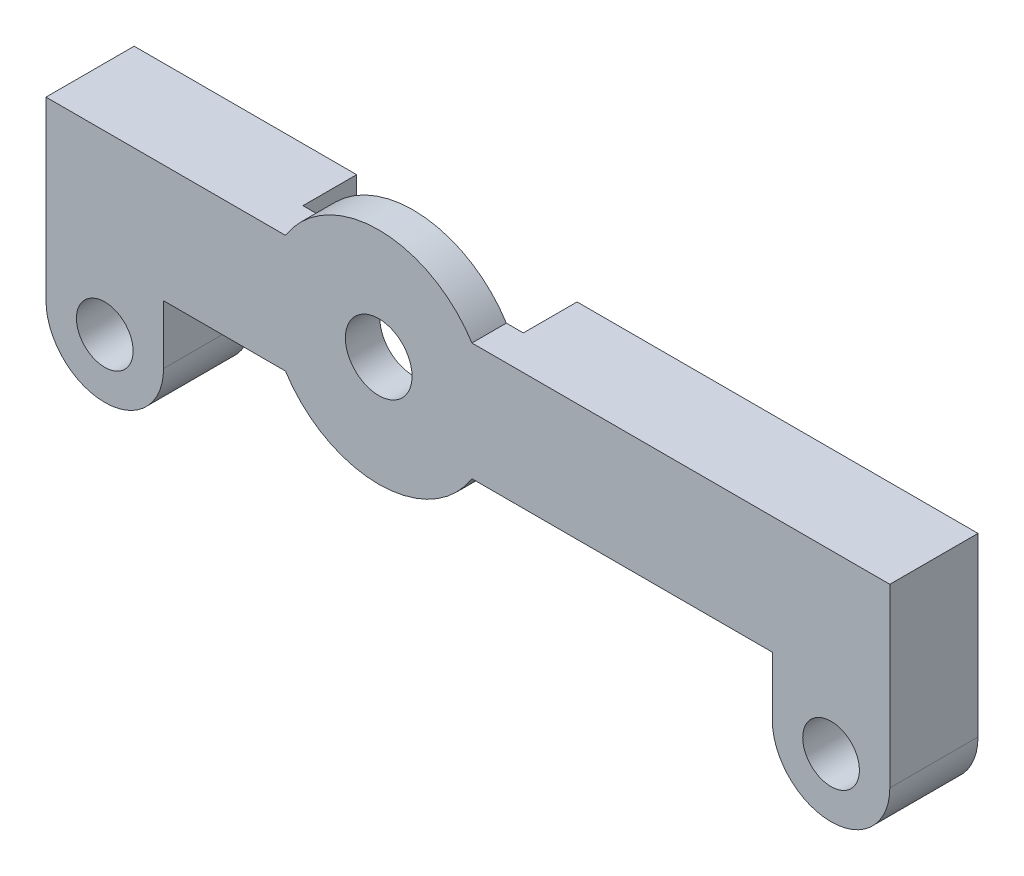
ISO-10303-21;
HEADER;
FILE_DESCRIPTION(('STEP AP214'),'2;1');
FILE_NAME('part.step','',(''),(''),'','','');
FILE_SCHEMA(('AUTOMOTIVE_DESIGN { 1 0 10303 214 1 1 1 1 }'));
ENDSEC;
DATA;
#1=APPLICATION_CONTEXT('core data for automotive mechanical design processes');
#2=APPLICATION_PROTOCOL_DEFINITION('international standard','automotive_design',2000,#1);
#3=PRODUCT_CONTEXT('',#1,'mechanical');
#4=PRODUCT('Part','Part','',(#3));
#5=PRODUCT_RELATED_PRODUCT_CATEGORY('part','',(#4));
#6=PRODUCT_DEFINITION_FORMATION('','',#4);
#7=PRODUCT_DEFINITION_CONTEXT('part definition',#1,'design');
#8=PRODUCT_DEFINITION('design','',#6,#7);
#9=PRODUCT_DEFINITION_SHAPE('','',#8);
#10=(LENGTH_UNIT() NAMED_UNIT(*) SI_UNIT(.MILLI.,.METRE.));
#11=(NAMED_UNIT(*) PLANE_ANGLE_UNIT() SI_UNIT($,.RADIAN.));
#12=(NAMED_UNIT(*) SI_UNIT($,.STERADIAN.) SOLID_ANGLE_UNIT());
#13=UNCERTAINTY_MEASURE_WITH_UNIT(LENGTH_MEASURE(1.E-05),#10,'distance_accuracy_value','');
#14=(GEOMETRIC_REPRESENTATION_CONTEXT(3) GLOBAL_UNCERTAINTY_ASSIGNED_CONTEXT((#13)) GLOBAL_UNIT_ASSIGNED_CONTEXT((#10,
#11,#12)) REPRESENTATION_CONTEXT('',''));
#15=CARTESIAN_POINT('',(0.,0.,0.));
#16=DIRECTION('',(0.,0.,1.));
#17=DIRECTION('',(1.,0.,0.));
#18=AXIS2_PLACEMENT_3D('',#15,#16,#17);
#19=CARTESIAN_POINT('',(-14.5,2.8,4.2));
#20=DIRECTION('',(0.,1.,0.));
#21=DIRECTION('',(0.,0.,1.));
#22=AXIS2_PLACEMENT_3D('',#19,#20,#21);
#23=PLANE('',#22);
#24=DIRECTION('',(-1.,0.,0.));
#25=VECTOR('',#24,1.);
#26=CARTESIAN_POINT('',(-9.5,2.8,2.56));
#27=LINE('',#26,#25);
#28=CARTESIAN_POINT('',(-8.69100213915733,2.8,2.56));
#29=VERTEX_POINT('',#28);
#30=CARTESIAN_POINT('',(-9.5,2.8,2.56));
#31=VERTEX_POINT('',#30);
#32=EDGE_CURVE('E306',#29,#31,#27,.T.);
#33=ORIENTED_EDGE('',*,*,#32,.F.);
#34=DIRECTION('',(0.,0.,1.));
#35=VECTOR('',#34,1.);
#36=CARTESIAN_POINT('',(-8.69100213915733,2.8,-12.2892424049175));
#37=LINE('',#36,#35);
#38=CARTESIAN_POINT('',(-8.69100213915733,2.8,4.2));
#39=VERTEX_POINT('',#38);
#40=EDGE_CURVE('E239',#29,#39,#37,.T.);
#41=ORIENTED_EDGE('',*,*,#40,.T.);
#42=DIRECTION('',(1.,0.,0.));
#43=VECTOR('',#42,1.);
#44=CARTESIAN_POINT('',(-14.5,2.8,4.2));
#45=LINE('',#44,#43);
#46=CARTESIAN_POINT('',(-14.5,2.8,4.2));
#47=VERTEX_POINT('',#46);
#48=EDGE_CURVE('E226',#47,#39,#45,.T.);
#49=ORIENTED_EDGE('',*,*,#48,.F.);
#50=DIRECTION('',(0.,0.,-1.));
#51=VECTOR('',#50,1.);
#52=CARTESIAN_POINT('',(-14.5,2.8,4.2));
#53=LINE('',#52,#51);
#54=CARTESIAN_POINT('',(-14.5,2.8,0.));
#55=VERTEX_POINT('',#54);
#56=EDGE_CURVE('E41',#47,#55,#53,.T.);
#57=ORIENTED_EDGE('',*,*,#56,.T.);
#58=DIRECTION('',(1.,0.,0.));
#59=VECTOR('',#58,1.);
#60=CARTESIAN_POINT('',(-14.5,2.8,0.));
#61=LINE('',#60,#59);
#62=CARTESIAN_POINT('',(-9.5,2.8,0.));
#63=VERTEX_POINT('',#62);
#64=EDGE_CURVE('E185',#55,#63,#61,.T.);
#65=ORIENTED_EDGE('',*,*,#64,.T.);
#66=DIRECTION('',(0.,0.,-1.));
#67=VECTOR('',#66,1.);
#68=CARTESIAN_POINT('',(-9.5,2.8,2.56));
#69=LINE('',#68,#67);
#70=EDGE_CURVE('E248',#31,#63,#69,.T.);
#71=ORIENTED_EDGE('',*,*,#70,.F.);
#72=EDGE_LOOP('',(#33,#41,#49,#57,#65,#71));
#73=FACE_BOUND('',#72,.T.);
#74=ADVANCED_FACE('F32',(#73),#23,.F.);
#75=CARTESIAN_POINT('',(-20.1,8.4,4.2));
#76=DIRECTION('',(0.,-1.,0.));
#77=DIRECTION('',(0.,0.,-1.));
#78=AXIS2_PLACEMENT_3D('',#75,#76,#77);
#79=PLANE('',#78);
#80=DIRECTION('',(1.,0.,0.));
#81=VECTOR('',#80,1.);
#82=CARTESIAN_POINT('',(-9.5,8.4,2.56));
#83=LINE('',#82,#81);
#84=CARTESIAN_POINT('',(0.191002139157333,8.4,2.56));
#85=VERTEX_POINT('',#84);
#86=CARTESIAN_POINT('',(1.,8.4,2.56));
#87=VERTEX_POINT('',#86);
#88=EDGE_CURVE('E162',#85,#87,#83,.T.);
#89=ORIENTED_EDGE('',*,*,#88,.F.);
#90=DIRECTION('',(0.,0.,1.));
#91=VECTOR('',#90,1.);
#92=CARTESIAN_POINT('',(0.191002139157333,8.4,-12.2892424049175));
#93=LINE('',#92,#91);
#94=CARTESIAN_POINT('',(0.191002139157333,8.4,4.2));
#95=VERTEX_POINT('',#94);
#96=EDGE_CURVE('E147',#85,#95,#93,.T.);
#97=ORIENTED_EDGE('',*,*,#96,.T.);
#98=DIRECTION('',(-1.,0.,0.));
#99=VECTOR('',#98,1.);
#100=CARTESIAN_POINT('',(-20.1,8.4,4.2));
#101=LINE('',#100,#99);
#102=CARTESIAN_POINT('',(20.1,8.4,4.2));
#103=VERTEX_POINT('',#102);
#104=EDGE_CURVE('E160',#103,#95,#101,.T.);
#105=ORIENTED_EDGE('',*,*,#104,.F.);
#106=DIRECTION('',(0.,0.,-1.));
#107=VECTOR('',#106,1.);
#108=CARTESIAN_POINT('',(20.1,8.4,4.2));
#109=LINE('',#108,#107);
#110=CARTESIAN_POINT('',(20.1,8.4,0.));
#111=VERTEX_POINT('',#110);
#112=EDGE_CURVE('E206',#103,#111,#109,.T.);
#113=ORIENTED_EDGE('',*,*,#112,.T.);
#114=DIRECTION('',(-1.,0.,0.));
#115=VECTOR('',#114,1.);
#116=CARTESIAN_POINT('',(-20.1,8.4,0.));
#117=LINE('',#116,#115);
#118=CARTESIAN_POINT('',(1.,8.4,0.));
#119=VERTEX_POINT('',#118);
#120=EDGE_CURVE('E195',#111,#119,#117,.T.);
#121=ORIENTED_EDGE('',*,*,#120,.T.);
#122=DIRECTION('',(0.,0.,-1.));
#123=VECTOR('',#122,1.);
#124=CARTESIAN_POINT('',(1.,8.4,2.56));
#125=LINE('',#124,#123);
#126=EDGE_CURVE('E253',#87,#119,#125,.T.);
#127=ORIENTED_EDGE('',*,*,#126,.F.);
#128=EDGE_LOOP('',(#89,#97,#105,#113,#121,#127));
#129=FACE_BOUND('',#128,.T.);
#130=ADVANCED_FACE('F158',(#129),#79,.F.);
#131=CARTESIAN_POINT('',(-17.3,0.,0.));
#132=DIRECTION('',(0.,0.,1.));
#133=DIRECTION('',(1.,0.,0.));
#134=AXIS2_PLACEMENT_3D('',#131,#132,#133);
#135=PLANE('',#134);
#136=CARTESIAN_POINT('',(-17.3,0.,0.));
#137=DIRECTION('',(0.,0.,1.));
#138=DIRECTION('',(1.,0.,0.));
#139=AXIS2_PLACEMENT_3D('',#136,#137,#138);
#140=CIRCLE('',#139,1.35);
#141=CARTESIAN_POINT('',(-15.95,0.,0.));
#142=VERTEX_POINT('',#141);
#143=EDGE_CURVE('E266',#142,#142,#140,.T.);
#144=ORIENTED_EDGE('',*,*,#143,.T.);
#145=EDGE_LOOP('',(#144));
#146=FACE_BOUND('',#145,.T.);
#147=CARTESIAN_POINT('',(-9.5,8.4,0.));
#148=VERTEX_POINT('',#147);
#149=CARTESIAN_POINT('',(-20.1,8.4,0.));
#150=VERTEX_POINT('',#149);
#151=EDGE_CURVE('E194',#148,#150,#117,.T.);
#152=ORIENTED_EDGE('',*,*,#151,.F.);
#153=DIRECTION('',(0.,1.,0.));
#154=VECTOR('',#153,1.);
#155=CARTESIAN_POINT('',(-9.5,2.8,0.));
#156=LINE('',#155,#154);
#157=EDGE_CURVE('E233',#63,#148,#156,.T.);
#158=ORIENTED_EDGE('',*,*,#157,.F.);
#159=ORIENTED_EDGE('',*,*,#64,.F.);
#160=DIRECTION('',(0.,1.,0.));
#161=VECTOR('',#160,1.);
#162=CARTESIAN_POINT('',(-14.5,0.,0.));
#163=LINE('',#162,#161);
#164=CARTESIAN_POINT('',(-14.5,0.,0.));
#165=VERTEX_POINT('',#164);
#166=EDGE_CURVE('E181',#165,#55,#163,.T.);
#167=ORIENTED_EDGE('',*,*,#166,.F.);
#168=CARTESIAN_POINT('',(-17.3,0.,0.));
#169=DIRECTION('',(0.,0.,1.));
#170=DIRECTION('',(1.,0.,0.));
#171=AXIS2_PLACEMENT_3D('',#168,#169,#170);
#172=CIRCLE('',#171,2.8);
#173=CARTESIAN_POINT('',(-20.1,0.,0.));
#174=VERTEX_POINT('',#173);
#175=EDGE_CURVE('E178',#174,#165,#172,.T.);
#176=ORIENTED_EDGE('',*,*,#175,.F.);
#177=DIRECTION('',(0.,-1.,0.));
#178=VECTOR('',#177,1.);
#179=CARTESIAN_POINT('',(-20.1,0.,0.));
#180=LINE('',#179,#178);
#181=EDGE_CURVE('E198',#150,#174,#180,.T.);
#182=ORIENTED_EDGE('',*,*,#181,.F.);
#183=EDGE_LOOP('',(#152,#158,#159,#167,#176,#182));
#184=FACE_BOUND('',#183,.T.);
#185=ADVANCED_FACE('F231',(#146,#184),#135,.F.);
#186=CARTESIAN_POINT('',(-4.25,5.6,4.2));
#187=DIRECTION('',(0.,0.,-1.));
#188=DIRECTION('',(-1.,0.,0.));
#189=AXIS2_PLACEMENT_3D('',#186,#187,#188);
#190=CYLINDRICAL_SURFACE('',#189,1.5875);
#191=CARTESIAN_POINT('',(-4.25,5.6,4.2));
#192=DIRECTION('',(0.,0.,1.));
#193=DIRECTION('',(1.,0.,0.));
#194=AXIS2_PLACEMENT_3D('',#191,#192,#193);
#195=CIRCLE('',#194,1.5875);
#196=CARTESIAN_POINT('',(-2.6625,5.6,4.2));
#197=VERTEX_POINT('',#196);
#198=EDGE_CURVE('E260',#197,#197,#195,.T.);
#199=ORIENTED_EDGE('',*,*,#198,.T.);
#200=EDGE_LOOP('',(#199));
#201=FACE_BOUND('',#200,.T.);
#202=CARTESIAN_POINT('',(-4.25,5.6,2.56));
#203=DIRECTION('',(0.,0.,-1.));
#204=DIRECTION('',(-1.,0.,0.));
#205=AXIS2_PLACEMENT_3D('',#202,#203,#204);
#206=CIRCLE('',#205,1.5875);
#207=CARTESIAN_POINT('',(-5.8375,5.6,2.56));
#208=VERTEX_POINT('',#207);
#209=EDGE_CURVE('E36',#208,#208,#206,.T.);
#210=ORIENTED_EDGE('',*,*,#209,.T.);
#211=EDGE_LOOP('',(#210));
#212=FACE_BOUND('',#211,.T.);
#213=ADVANCED_FACE('F368',(#201,#212),#190,.F.);
#214=CARTESIAN_POINT('',(-17.3,0.,4.2));
#215=DIRECTION('',(0.,0.,1.));
#216=DIRECTION('',(1.,0.,0.));
#217=AXIS2_PLACEMENT_3D('',#214,#215,#216);
#218=PLANE('',#217);
#219=ORIENTED_EDGE('',*,*,#104,.T.);
#220=CARTESIAN_POINT('',(-4.25,5.6,4.2));
#221=DIRECTION('',(0.,0.,1.));
#222=DIRECTION('',(1.,0.,0.));
#223=AXIS2_PLACEMENT_3D('',#220,#221,#222);
#224=CIRCLE('',#223,5.25);
#225=CARTESIAN_POINT('',(-8.69100213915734,8.4,4.2));
#226=VERTEX_POINT('',#225);
#227=EDGE_CURVE('E144',#95,#226,#224,.T.);
#228=ORIENTED_EDGE('',*,*,#227,.T.);
#229=CARTESIAN_POINT('',(-20.1,8.4,4.2));
#230=VERTEX_POINT('',#229);
#231=EDGE_CURVE('E171',#226,#230,#101,.T.);
#232=ORIENTED_EDGE('',*,*,#231,.T.);
#233=DIRECTION('',(0.,-1.,0.));
#234=VECTOR('',#233,1.);
#235=CARTESIAN_POINT('',(-20.1,0.,4.2));
#236=LINE('',#235,#234);
#237=CARTESIAN_POINT('',(-20.1,0.,4.2));
#238=VERTEX_POINT('',#237);
#239=EDGE_CURVE('E170',#230,#238,#236,.T.);
#240=ORIENTED_EDGE('',*,*,#239,.T.);
#241=CARTESIAN_POINT('',(-17.3,0.,4.2));
#242=DIRECTION('',(0.,0.,1.));
#243=DIRECTION('',(1.,0.,0.));
#244=AXIS2_PLACEMENT_3D('',#241,#242,#243);
#245=CIRCLE('',#244,2.8);
#246=CARTESIAN_POINT('',(-14.5,0.,4.2));
#247=VERTEX_POINT('',#246);
#248=EDGE_CURVE('E200',#238,#247,#245,.T.);
#249=ORIENTED_EDGE('',*,*,#248,.T.);
#250=DIRECTION('',(0.,1.,0.));
#251=VECTOR('',#250,1.);
#252=CARTESIAN_POINT('',(-14.5,0.,4.2));
#253=LINE('',#252,#251);
#254=EDGE_CURVE('E273',#247,#47,#253,.T.);
#255=ORIENTED_EDGE('',*,*,#254,.T.);
#256=ORIENTED_EDGE('',*,*,#48,.T.);
#257=CARTESIAN_POINT('',(0.191002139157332,2.8,4.2));
#258=VERTEX_POINT('',#257);
#259=EDGE_CURVE('E154',#39,#258,#224,.T.);
#260=ORIENTED_EDGE('',*,*,#259,.T.);
#261=CARTESIAN_POINT('',(14.5,2.8,4.2));
#262=VERTEX_POINT('',#261);
#263=EDGE_CURVE('E275',#258,#262,#45,.T.);
#264=ORIENTED_EDGE('',*,*,#263,.T.);
#265=DIRECTION('',(0.,-1.,0.));
#266=VECTOR('',#265,1.);
#267=CARTESIAN_POINT('',(14.5,0.,4.2));
#268=LINE('',#267,#266);
#269=CARTESIAN_POINT('',(14.5,0.,4.2));
#270=VERTEX_POINT('',#269);
#271=EDGE_CURVE('E277',#262,#270,#268,.T.);
#272=ORIENTED_EDGE('',*,*,#271,.T.);
#273=CARTESIAN_POINT('',(17.3,0.,4.2));
#274=DIRECTION('',(0.,0.,1.));
#275=DIRECTION('',(-1.,0.,0.));
#276=AXIS2_PLACEMENT_3D('',#273,#274,#275);
#277=CIRCLE('',#276,2.8);
#278=CARTESIAN_POINT('',(20.1,0.,4.2));
#279=VERTEX_POINT('',#278);
#280=EDGE_CURVE('E278',#270,#279,#277,.T.);
#281=ORIENTED_EDGE('',*,*,#280,.T.);
#282=DIRECTION('',(0.,1.,0.));
#283=VECTOR('',#282,1.);
#284=CARTESIAN_POINT('',(20.1,0.,4.2));
#285=LINE('',#284,#283);
#286=EDGE_CURVE('E168',#279,#103,#285,.T.);
#287=ORIENTED_EDGE('',*,*,#286,.T.);
#288=EDGE_LOOP('',(#219,#228,#232,#240,#249,#255,#256,#260,#264,#272,#281,#287));
#289=FACE_BOUND('',#288,.T.);
#290=CARTESIAN_POINT('',(17.3,0.,4.2));
#291=DIRECTION('',(0.,0.,1.));
#292=DIRECTION('',(-1.,0.,0.));
#293=AXIS2_PLACEMENT_3D('',#290,#291,#292);
#294=CIRCLE('',#293,1.35);
#295=CARTESIAN_POINT('',(15.95,0.,4.2));
#296=VERTEX_POINT('',#295);
#297=EDGE_CURVE('E257',#296,#296,#294,.T.);
#298=ORIENTED_EDGE('',*,*,#297,.F.);
#299=EDGE_LOOP('',(#298));
#300=FACE_BOUND('',#299,.T.);
#301=ORIENTED_EDGE('',*,*,#198,.F.);
#302=EDGE_LOOP('',(#301));
#303=FACE_BOUND('',#302,.T.);
#304=CARTESIAN_POINT('',(-17.3,0.,4.2));
#305=DIRECTION('',(0.,0.,1.));
#306=DIRECTION('',(1.,0.,0.));
#307=AXIS2_PLACEMENT_3D('',#304,#305,#306);
#308=CIRCLE('',#307,1.35);
#309=CARTESIAN_POINT('',(-15.95,0.,4.2));
#310=VERTEX_POINT('',#309);
#311=EDGE_CURVE('E182',#310,#310,#308,.T.);
#312=ORIENTED_EDGE('',*,*,#311,.F.);
#313=EDGE_LOOP('',(#312));
#314=FACE_BOUND('',#313,.T.);
#315=ADVANCED_FACE('F165',(#289,#300,#303,#314),#218,.T.);
#316=CARTESIAN_POINT('',(1.,2.8,0.));
#317=VERTEX_POINT('',#316);
#318=CARTESIAN_POINT('',(14.5,2.8,0.));
#319=VERTEX_POINT('',#318);
#320=EDGE_CURVE('E184',#317,#319,#61,.T.);
#321=ORIENTED_EDGE('',*,*,#320,.F.);
#322=DIRECTION('',(0.,-1.,0.));
#323=VECTOR('',#322,1.);
#324=CARTESIAN_POINT('',(1.,2.8,0.));
#325=LINE('',#324,#323);
#326=EDGE_CURVE('E238',#119,#317,#325,.T.);
#327=ORIENTED_EDGE('',*,*,#326,.F.);
#328=ORIENTED_EDGE('',*,*,#120,.F.);
#329=DIRECTION('',(0.,1.,0.));
#330=VECTOR('',#329,1.);
#331=CARTESIAN_POINT('',(20.1,0.,0.));
#332=LINE('',#331,#330);
#333=CARTESIAN_POINT('',(20.1,0.,0.));
#334=VERTEX_POINT('',#333);
#335=EDGE_CURVE('E192',#334,#111,#332,.T.);
#336=ORIENTED_EDGE('',*,*,#335,.F.);
#337=CARTESIAN_POINT('',(17.3,0.,0.));
#338=DIRECTION('',(0.,0.,1.));
#339=DIRECTION('',(-1.,0.,0.));
#340=AXIS2_PLACEMENT_3D('',#337,#338,#339);
#341=CIRCLE('',#340,2.8);
#342=CARTESIAN_POINT('',(14.5,0.,0.));
#343=VERTEX_POINT('',#342);
#344=EDGE_CURVE('E190',#343,#334,#341,.T.);
#345=ORIENTED_EDGE('',*,*,#344,.F.);
#346=DIRECTION('',(0.,-1.,0.));
#347=VECTOR('',#346,1.);
#348=CARTESIAN_POINT('',(14.5,0.,0.));
#349=LINE('',#348,#347);
#350=EDGE_CURVE('E188',#319,#343,#349,.T.);
#351=ORIENTED_EDGE('',*,*,#350,.F.);
#352=EDGE_LOOP('',(#321,#327,#328,#336,#345,#351));
#353=FACE_BOUND('',#352,.T.);
#354=CARTESIAN_POINT('',(17.3,0.,0.));
#355=DIRECTION('',(0.,0.,1.));
#356=DIRECTION('',(-1.,0.,0.));
#357=AXIS2_PLACEMENT_3D('',#354,#355,#356);
#358=CIRCLE('',#357,1.35);
#359=CARTESIAN_POINT('',(15.95,0.,0.));
#360=VERTEX_POINT('',#359);
#361=EDGE_CURVE('E261',#360,#360,#358,.T.);
#362=ORIENTED_EDGE('',*,*,#361,.T.);
#363=EDGE_LOOP('',(#362));
#364=FACE_BOUND('',#363,.T.);
#365=ADVANCED_FACE('F293',(#353,#364),#135,.F.);
#366=CARTESIAN_POINT('',(-17.3,0.,4.2));
#367=DIRECTION('',(0.,0.,-1.));
#368=DIRECTION('',(-1.,0.,0.));
#369=AXIS2_PLACEMENT_3D('',#366,#367,#368);
#370=CYLINDRICAL_SURFACE('',#369,2.8);
#371=ORIENTED_EDGE('',*,*,#175,.T.);
#372=DIRECTION('',(0.,0.,-1.));
#373=VECTOR('',#372,1.);
#374=CARTESIAN_POINT('',(-14.5,0.,4.2));
#375=LINE('',#374,#373);
#376=EDGE_CURVE('E11',#247,#165,#375,.T.);
#377=ORIENTED_EDGE('',*,*,#376,.F.);
#378=ORIENTED_EDGE('',*,*,#248,.F.);
#379=DIRECTION('',(0.,0.,-1.));
#380=VECTOR('',#379,1.);
#381=CARTESIAN_POINT('',(-20.1,0.,4.2));
#382=LINE('',#381,#380);
#383=EDGE_CURVE('E173',#238,#174,#382,.T.);
#384=ORIENTED_EDGE('',*,*,#383,.T.);
#385=EDGE_LOOP('',(#371,#377,#378,#384));
#386=FACE_BOUND('',#385,.T.);
#387=ADVANCED_FACE('F34',(#386),#370,.T.);
#388=CARTESIAN_POINT('',(-14.5,0.,4.2));
#389=DIRECTION('',(-1.,0.,0.));
#390=DIRECTION('',(0.,0.,1.));
#391=AXIS2_PLACEMENT_3D('',#388,#389,#390);
#392=PLANE('',#391);
#393=ORIENTED_EDGE('',*,*,#166,.T.);
#394=ORIENTED_EDGE('',*,*,#56,.F.);
#395=ORIENTED_EDGE('',*,*,#254,.F.);
#396=ORIENTED_EDGE('',*,*,#376,.T.);
#397=EDGE_LOOP('',(#393,#394,#395,#396));
#398=FACE_BOUND('',#397,.T.);
#399=ADVANCED_FACE('F326',(#398),#392,.F.);
#400=ORIENTED_EDGE('',*,*,#263,.F.);
#401=DIRECTION('',(0.,0.,1.));
#402=VECTOR('',#401,1.);
#403=CARTESIAN_POINT('',(0.191002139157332,2.8,-12.2892424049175));
#404=LINE('',#403,#402);
#405=CARTESIAN_POINT('',(0.191002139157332,2.8,2.56));
#406=VERTEX_POINT('',#405);
#407=EDGE_CURVE('E163',#258,#406,#404,.F.);
#408=ORIENTED_EDGE('',*,*,#407,.T.);
#409=CARTESIAN_POINT('',(1.,2.8,2.56));
#410=VERTEX_POINT('',#409);
#411=EDGE_CURVE('E245',#410,#406,#27,.T.);
#412=ORIENTED_EDGE('',*,*,#411,.F.);
#413=DIRECTION('',(0.,0.,-1.));
#414=VECTOR('',#413,1.);
#415=CARTESIAN_POINT('',(1.,2.8,2.56));
#416=LINE('',#415,#414);
#417=EDGE_CURVE('E250',#410,#317,#416,.T.);
#418=ORIENTED_EDGE('',*,*,#417,.T.);
#419=ORIENTED_EDGE('',*,*,#320,.T.);
#420=DIRECTION('',(0.,0.,-1.));
#421=VECTOR('',#420,1.);
#422=CARTESIAN_POINT('',(14.5,2.8,4.2));
#423=LINE('',#422,#421);
#424=EDGE_CURVE('E214',#262,#319,#423,.T.);
#425=ORIENTED_EDGE('',*,*,#424,.F.);
#426=EDGE_LOOP('',(#400,#408,#412,#418,#419,#425));
#427=FACE_BOUND('',#426,.T.);
#428=ADVANCED_FACE('F303',(#427),#23,.F.);
#429=CARTESIAN_POINT('',(14.5,0.,4.2));
#430=DIRECTION('',(1.,0.,0.));
#431=DIRECTION('',(0.,0.,-1.));
#432=AXIS2_PLACEMENT_3D('',#429,#430,#431);
#433=PLANE('',#432);
#434=ORIENTED_EDGE('',*,*,#350,.T.);
#435=DIRECTION('',(0.,0.,-1.));
#436=VECTOR('',#435,1.);
#437=CARTESIAN_POINT('',(14.5,0.,4.2));
#438=LINE('',#437,#436);
#439=EDGE_CURVE('E211',#270,#343,#438,.T.);
#440=ORIENTED_EDGE('',*,*,#439,.F.);
#441=ORIENTED_EDGE('',*,*,#271,.F.);
#442=ORIENTED_EDGE('',*,*,#424,.T.);
#443=EDGE_LOOP('',(#434,#440,#441,#442));
#444=FACE_BOUND('',#443,.T.);
#445=ADVANCED_FACE('F318',(#444),#433,.F.);
#446=CARTESIAN_POINT('',(17.3,0.,4.2));
#447=DIRECTION('',(0.,0.,-1.));
#448=DIRECTION('',(-1.,0.,0.));
#449=AXIS2_PLACEMENT_3D('',#446,#447,#448);
#450=CYLINDRICAL_SURFACE('',#449,2.8);
#451=ORIENTED_EDGE('',*,*,#344,.T.);
#452=DIRECTION('',(0.,0.,-1.));
#453=VECTOR('',#452,1.);
#454=CARTESIAN_POINT('',(20.1,0.,4.2));
#455=LINE('',#454,#453);
#456=EDGE_CURVE('E208',#279,#334,#455,.T.);
#457=ORIENTED_EDGE('',*,*,#456,.F.);
#458=ORIENTED_EDGE('',*,*,#280,.F.);
#459=ORIENTED_EDGE('',*,*,#439,.T.);
#460=EDGE_LOOP('',(#451,#457,#458,#459));
#461=FACE_BOUND('',#460,.T.);
#462=ADVANCED_FACE('F284',(#461),#450,.T.);
#463=CARTESIAN_POINT('',(20.1,0.,4.2));
#464=DIRECTION('',(-1.,0.,0.));
#465=DIRECTION('',(0.,0.,1.));
#466=AXIS2_PLACEMENT_3D('',#463,#464,#465);
#467=PLANE('',#466);
#468=ORIENTED_EDGE('',*,*,#335,.T.);
#469=ORIENTED_EDGE('',*,*,#112,.F.);
#470=ORIENTED_EDGE('',*,*,#286,.F.);
#471=ORIENTED_EDGE('',*,*,#456,.T.);
#472=EDGE_LOOP('',(#468,#469,#470,#471));
#473=FACE_BOUND('',#472,.T.);
#474=ADVANCED_FACE('F288',(#473),#467,.F.);
#475=ORIENTED_EDGE('',*,*,#231,.F.);
#476=DIRECTION('',(0.,0.,1.));
#477=VECTOR('',#476,1.);
#478=CARTESIAN_POINT('',(-8.69100213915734,8.4,-12.2892424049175));
#479=LINE('',#478,#477);
#480=CARTESIAN_POINT('',(-8.69100213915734,8.4,2.56));
#481=VERTEX_POINT('',#480);
#482=EDGE_CURVE('E150',#226,#481,#479,.F.);
#483=ORIENTED_EDGE('',*,*,#482,.T.);
#484=CARTESIAN_POINT('',(-9.5,8.4,2.56));
#485=VERTEX_POINT('',#484);
#486=EDGE_CURVE('E309',#485,#481,#83,.T.);
#487=ORIENTED_EDGE('',*,*,#486,.F.);
#488=DIRECTION('',(0.,0.,-1.));
#489=VECTOR('',#488,1.);
#490=CARTESIAN_POINT('',(-9.5,8.4,2.56));
#491=LINE('',#490,#489);
#492=EDGE_CURVE('E255',#485,#148,#491,.T.);
#493=ORIENTED_EDGE('',*,*,#492,.T.);
#494=ORIENTED_EDGE('',*,*,#151,.T.);
#495=DIRECTION('',(0.,0.,-1.));
#496=VECTOR('',#495,1.);
#497=CARTESIAN_POINT('',(-20.1,8.4,4.2));
#498=LINE('',#497,#496);
#499=EDGE_CURVE('E203',#230,#150,#498,.T.);
#500=ORIENTED_EDGE('',*,*,#499,.F.);
#501=EDGE_LOOP('',(#475,#483,#487,#493,#494,#500));
#502=FACE_BOUND('',#501,.T.);
#503=ADVANCED_FACE('F333',(#502),#79,.F.);
#504=CARTESIAN_POINT('',(-20.1,0.,4.2));
#505=DIRECTION('',(1.,0.,0.));
#506=DIRECTION('',(0.,0.,-1.));
#507=AXIS2_PLACEMENT_3D('',#504,#505,#506);
#508=PLANE('',#507);
#509=ORIENTED_EDGE('',*,*,#181,.T.);
#510=ORIENTED_EDGE('',*,*,#383,.F.);
#511=ORIENTED_EDGE('',*,*,#239,.F.);
#512=ORIENTED_EDGE('',*,*,#499,.T.);
#513=EDGE_LOOP('',(#509,#510,#511,#512));
#514=FACE_BOUND('',#513,.T.);
#515=ADVANCED_FACE('F343',(#514),#508,.F.);
#516=CARTESIAN_POINT('',(-17.3,0.,4.2));
#517=DIRECTION('',(0.,0.,-1.));
#518=DIRECTION('',(-1.,0.,0.));
#519=AXIS2_PLACEMENT_3D('',#516,#517,#518);
#520=CYLINDRICAL_SURFACE('',#519,1.35);
#521=ORIENTED_EDGE('',*,*,#311,.T.);
#522=EDGE_LOOP('',(#521));
#523=FACE_BOUND('',#522,.T.);
#524=ORIENTED_EDGE('',*,*,#143,.F.);
#525=EDGE_LOOP('',(#524));
#526=FACE_BOUND('',#525,.T.);
#527=ADVANCED_FACE('F366',(#523,#526),#520,.F.);
#528=CARTESIAN_POINT('',(17.3,0.,4.2));
#529=DIRECTION('',(0.,0.,-1.));
#530=DIRECTION('',(-1.,0.,0.));
#531=AXIS2_PLACEMENT_3D('',#528,#529,#530);
#532=CYLINDRICAL_SURFACE('',#531,1.35);
#533=ORIENTED_EDGE('',*,*,#297,.T.);
#534=EDGE_LOOP('',(#533));
#535=FACE_BOUND('',#534,.T.);
#536=ORIENTED_EDGE('',*,*,#361,.F.);
#537=EDGE_LOOP('',(#536));
#538=FACE_BOUND('',#537,.T.);
#539=ADVANCED_FACE('F363',(#535,#538),#532,.F.);
#540=CARTESIAN_POINT('',(-9.5,2.8,2.56));
#541=DIRECTION('',(-1.,0.,0.));
#542=DIRECTION('',(0.,0.,1.));
#543=AXIS2_PLACEMENT_3D('',#540,#541,#542);
#544=PLANE('',#543);
#545=ORIENTED_EDGE('',*,*,#157,.T.);
#546=ORIENTED_EDGE('',*,*,#492,.F.);
#547=DIRECTION('',(0.,1.,0.));
#548=VECTOR('',#547,1.);
#549=CARTESIAN_POINT('',(-9.5,2.8,2.56));
#550=LINE('',#549,#548);
#551=EDGE_CURVE('E241',#31,#485,#550,.T.);
#552=ORIENTED_EDGE('',*,*,#551,.F.);
#553=ORIENTED_EDGE('',*,*,#70,.T.);
#554=EDGE_LOOP('',(#545,#546,#552,#553));
#555=FACE_BOUND('',#554,.T.);
#556=ADVANCED_FACE('F348',(#555),#544,.F.);
#557=CARTESIAN_POINT('',(1.,2.8,2.56));
#558=DIRECTION('',(1.,0.,0.));
#559=DIRECTION('',(0.,0.,-1.));
#560=AXIS2_PLACEMENT_3D('',#557,#558,#559);
#561=PLANE('',#560);
#562=ORIENTED_EDGE('',*,*,#326,.T.);
#563=ORIENTED_EDGE('',*,*,#417,.F.);
#564=DIRECTION('',(0.,-1.,0.));
#565=VECTOR('',#564,1.);
#566=CARTESIAN_POINT('',(1.,2.8,2.56));
#567=LINE('',#566,#565);
#568=EDGE_CURVE('E307',#87,#410,#567,.T.);
#569=ORIENTED_EDGE('',*,*,#568,.F.);
#570=ORIENTED_EDGE('',*,*,#126,.T.);
#571=EDGE_LOOP('',(#562,#563,#569,#570));
#572=FACE_BOUND('',#571,.T.);
#573=ADVANCED_FACE('F298',(#572),#561,.F.);
#574=CARTESIAN_POINT('',(0.,0.,2.56));
#575=DIRECTION('',(0.,0.,-1.));
#576=DIRECTION('',(-1.,0.,0.));
#577=AXIS2_PLACEMENT_3D('',#574,#575,#576);
#578=PLANE('',#577);
#579=ORIENTED_EDGE('',*,*,#551,.T.);
#580=ORIENTED_EDGE('',*,*,#486,.T.);
#581=CARTESIAN_POINT('',(-4.25,5.6,2.56));
#582=DIRECTION('',(0.,0.,-1.));
#583=DIRECTION('',(-1.,0.,0.));
#584=AXIS2_PLACEMENT_3D('',#581,#582,#583);
#585=CIRCLE('',#584,5.25);
#586=EDGE_CURVE('E55',#85,#481,#585,.F.);
#587=ORIENTED_EDGE('',*,*,#586,.F.);
#588=ORIENTED_EDGE('',*,*,#88,.T.);
#589=ORIENTED_EDGE('',*,*,#568,.T.);
#590=ORIENTED_EDGE('',*,*,#411,.T.);
#591=EDGE_CURVE('E48',#29,#406,#585,.F.);
#592=ORIENTED_EDGE('',*,*,#591,.F.);
#593=ORIENTED_EDGE('',*,*,#32,.T.);
#594=EDGE_LOOP('',(#579,#580,#587,#588,#589,#590,#592,#593));
#595=FACE_BOUND('',#594,.T.);
#596=ORIENTED_EDGE('',*,*,#209,.F.);
#597=EDGE_LOOP('',(#596));
#598=FACE_BOUND('',#597,.T.);
#599=ADVANCED_FACE('F355',(#595,#598),#578,.T.);
#600=CARTESIAN_POINT('',(-4.25,5.6,-12.2892424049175));
#601=DIRECTION('',(0.,0.,1.));
#602=DIRECTION('',(1.,0.,0.));
#603=AXIS2_PLACEMENT_3D('',#600,#601,#602);
#604=CYLINDRICAL_SURFACE('',#603,5.25);
#605=ORIENTED_EDGE('',*,*,#96,.F.);
#606=ORIENTED_EDGE('',*,*,#586,.T.);
#607=ORIENTED_EDGE('',*,*,#482,.F.);
#608=ORIENTED_EDGE('',*,*,#227,.F.);
#609=EDGE_LOOP('',(#605,#606,#607,#608));
#610=FACE_BOUND('',#609,.T.);
#611=ADVANCED_FACE('F146',(#610),#604,.T.);
#612=ORIENTED_EDGE('',*,*,#40,.F.);
#613=ORIENTED_EDGE('',*,*,#591,.T.);
#614=ORIENTED_EDGE('',*,*,#407,.F.);
#615=ORIENTED_EDGE('',*,*,#259,.F.);
#616=EDGE_LOOP('',(#612,#613,#614,#615));
#617=FACE_BOUND('',#616,.T.);
#618=ADVANCED_FACE('F349',(#617),#604,.T.);
#619=CLOSED_SHELL('',(#74,#130,#185,#213,#315,#365,#387,#399,#428,#445,#462,#474,#503,#515,#527,
#539,#556,#573,#599,#611,#618));
#620=MANIFOLD_SOLID_BREP('B2',#619);
#621=ADVANCED_BREP_SHAPE_REPRESENTATION('',(#18,#620),#14);
#622=SHAPE_DEFINITION_REPRESENTATION(#9,#621);
ENDSEC;
END-ISO-10303-21;
